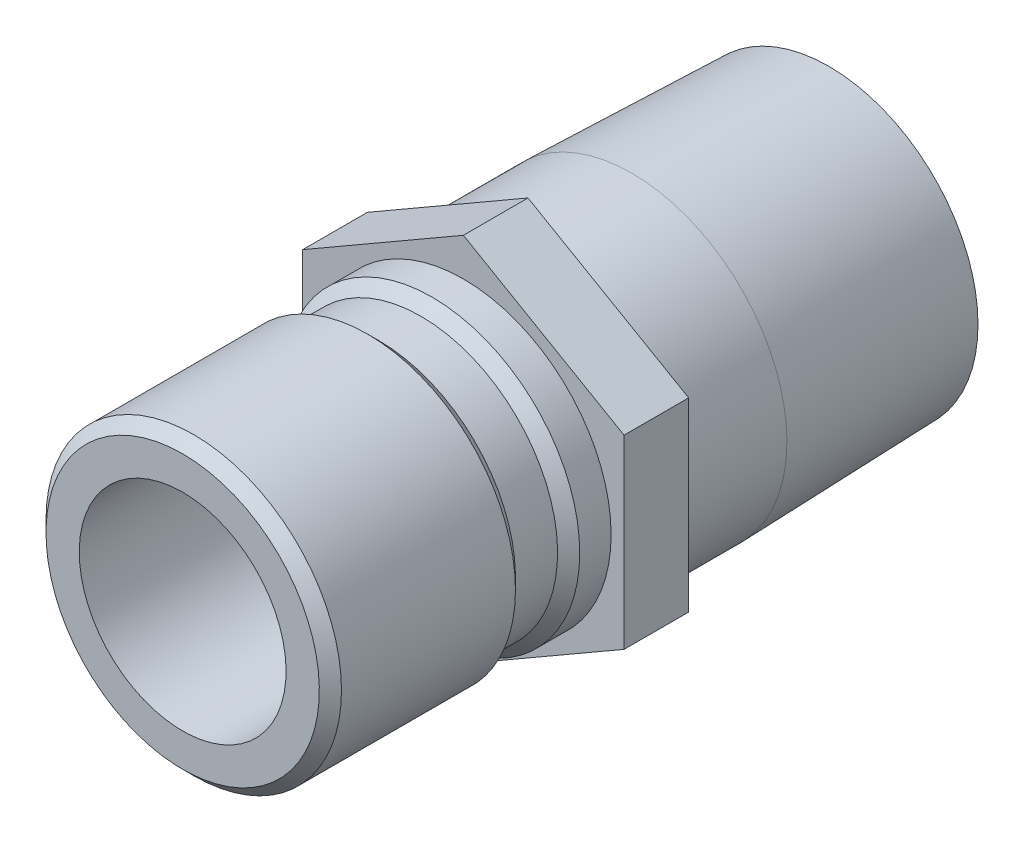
ISO-10303-21;
HEADER;
FILE_DESCRIPTION(('STEP AP214'),'2;1');
FILE_NAME('part.step','',(''),(''),'','','');
FILE_SCHEMA(('AUTOMOTIVE_DESIGN { 1 0 10303 214 1 1 1 1 }'));
ENDSEC;
DATA;
#1=APPLICATION_CONTEXT('core data for automotive mechanical design processes');
#2=APPLICATION_PROTOCOL_DEFINITION('international standard','automotive_design',2000,#1);
#3=PRODUCT_CONTEXT('',#1,'mechanical');
#4=PRODUCT('Part','Part','',(#3));
#5=PRODUCT_RELATED_PRODUCT_CATEGORY('part','',(#4));
#6=PRODUCT_DEFINITION_FORMATION('','',#4);
#7=PRODUCT_DEFINITION_CONTEXT('part definition',#1,'design');
#8=PRODUCT_DEFINITION('design','',#6,#7);
#9=PRODUCT_DEFINITION_SHAPE('','',#8);
#10=(LENGTH_UNIT() NAMED_UNIT(*) SI_UNIT(.MILLI.,.METRE.));
#11=(NAMED_UNIT(*) PLANE_ANGLE_UNIT() SI_UNIT($,.RADIAN.));
#12=(NAMED_UNIT(*) SI_UNIT($,.STERADIAN.) SOLID_ANGLE_UNIT());
#13=UNCERTAINTY_MEASURE_WITH_UNIT(LENGTH_MEASURE(1.E-05),#10,'distance_accuracy_value','');
#14=(GEOMETRIC_REPRESENTATION_CONTEXT(3) GLOBAL_UNCERTAINTY_ASSIGNED_CONTEXT((#13)) GLOBAL_UNIT_ASSIGNED_CONTEXT((#10,
#11,#12)) REPRESENTATION_CONTEXT('',''));
#15=CARTESIAN_POINT('',(0.,0.,0.));
#16=DIRECTION('',(0.,0.,1.));
#17=DIRECTION('',(1.,0.,0.));
#18=AXIS2_PLACEMENT_3D('',#15,#16,#17);
#19=CARTESIAN_POINT('',(0.,0.,0.));
#20=DIRECTION('',(0.,0.,-1.));
#21=DIRECTION('',(0.,1.,0.));
#22=AXIS2_PLACEMENT_3D('',#19,#20,#21);
#23=CYLINDRICAL_SURFACE('',#22,10.668);
#24=CARTESIAN_POINT('',(0.,0.,-11.5824));
#25=DIRECTION('',(0.,0.,-1.));
#26=DIRECTION('',(0.,1.,0.));
#27=AXIS2_PLACEMENT_3D('',#24,#25,#26);
#28=CIRCLE('',#27,10.668);
#29=CARTESIAN_POINT('',(0.,10.668,-11.5824));
#30=VERTEX_POINT('',#29);
#31=EDGE_CURVE('E42',#30,#30,#28,.T.);
#32=ORIENTED_EDGE('',*,*,#31,.F.);
#33=EDGE_LOOP('',(#32));
#34=FACE_BOUND('',#33,.T.);
#35=CARTESIAN_POINT('',(0.,0.,-4.445));
#36=DIRECTION('',(0.,0.,1.));
#37=DIRECTION('',(1.,0.,0.));
#38=AXIS2_PLACEMENT_3D('',#35,#36,#37);
#39=CIRCLE('',#38,10.668);
#40=CARTESIAN_POINT('',(10.668,0.,-4.445));
#41=VERTEX_POINT('',#40);
#42=EDGE_CURVE('E138',#41,#41,#39,.F.);
#43=ORIENTED_EDGE('',*,*,#42,.T.);
#44=EDGE_LOOP('',(#43));
#45=FACE_BOUND('',#44,.T.);
#46=ADVANCED_FACE('F33',(#34,#45),#23,.T.);
#47=CARTESIAN_POINT('',(0.,10.244140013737,-25.146));
#48=DIRECTION('',(0.,0.,-1.));
#49=DIRECTION('',(0.,1.,0.));
#50=AXIS2_PLACEMENT_3D('',#47,#48,#49);
#51=PLANE('',#50);
#52=CARTESIAN_POINT('',(0.,0.,-25.146));
#53=DIRECTION('',(0.,0.,-1.));
#54=DIRECTION('',(0.,1.,0.));
#55=AXIS2_PLACEMENT_3D('',#52,#53,#54);
#56=CIRCLE('',#55,10.244140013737);
#57=CARTESIAN_POINT('',(0.,10.244140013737,-25.146));
#58=VERTEX_POINT('',#57);
#59=EDGE_CURVE('E12',#58,#58,#56,.T.);
#60=ORIENTED_EDGE('',*,*,#59,.T.);
#61=EDGE_LOOP('',(#60));
#62=FACE_BOUND('',#61,.T.);
#63=CARTESIAN_POINT('',(0.,0.,-25.146));
#64=DIRECTION('',(0.,0.,-1.));
#65=DIRECTION('',(0.,1.,0.));
#66=AXIS2_PLACEMENT_3D('',#63,#64,#65);
#67=CIRCLE('',#66,7.8994);
#68=CARTESIAN_POINT('',(0.,7.8994,-25.146));
#69=VERTEX_POINT('',#68);
#70=EDGE_CURVE('E146',#69,#69,#67,.T.);
#71=ORIENTED_EDGE('',*,*,#70,.F.);
#72=EDGE_LOOP('',(#71));
#73=FACE_BOUND('',#72,.T.);
#74=ADVANCED_FACE('F35',(#62,#73),#51,.T.);
#75=CARTESIAN_POINT('',(0.,0.,-25.146));
#76=DIRECTION('',(0.,0.,1.));
#77=DIRECTION('',(0.,-1.,0.));
#78=AXIS2_PLACEMENT_3D('',#75,#76,#77);
#79=CONICAL_SURFACE('',#78,10.244140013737,0.0312396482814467);
#80=ORIENTED_EDGE('',*,*,#31,.T.);
#81=EDGE_LOOP('',(#80));
#82=FACE_BOUND('',#81,.T.);
#83=ORIENTED_EDGE('',*,*,#59,.F.);
#84=EDGE_LOOP('',(#83));
#85=FACE_BOUND('',#84,.T.);
#86=ADVANCED_FACE('F181',(#82,#85),#79,.T.);
#87=CARTESIAN_POINT('',(0.,10.16,0.));
#88=DIRECTION('',(0.,0.,1.));
#89=DIRECTION('',(0.,-1.,0.));
#90=AXIS2_PLACEMENT_3D('',#87,#88,#89);
#91=PLANE('',#90);
#92=CARTESIAN_POINT('',(0.,0.,0.));
#93=DIRECTION('',(0.,0.,-1.));
#94=DIRECTION('',(0.,1.,0.));
#95=AXIS2_PLACEMENT_3D('',#92,#93,#94);
#96=CIRCLE('',#95,10.16);
#97=CARTESIAN_POINT('',(0.,10.16,0.));
#98=VERTEX_POINT('',#97);
#99=EDGE_CURVE('E176',#98,#98,#96,.T.);
#100=ORIENTED_EDGE('',*,*,#99,.T.);
#101=EDGE_LOOP('',(#100));
#102=FACE_BOUND('',#101,.T.);
#103=DIRECTION('',(-0.866025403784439,-0.5,0.));
#104=VECTOR('',#103,1.);
#105=CARTESIAN_POINT('',(0.,12.7582862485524,0.));
#106=LINE('',#105,#104);
#107=CARTESIAN_POINT('',(0.,12.7582862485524,0.));
#108=VERTEX_POINT('',#107);
#109=CARTESIAN_POINT('',(-11.049,6.37914312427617,0.));
#110=VERTEX_POINT('',#109);
#111=EDGE_CURVE('E121',#108,#110,#106,.T.);
#112=ORIENTED_EDGE('',*,*,#111,.T.);
#113=DIRECTION('',(0.,-1.,0.));
#114=VECTOR('',#113,1.);
#115=CARTESIAN_POINT('',(-11.049,6.37914312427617,0.));
#116=LINE('',#115,#114);
#117=CARTESIAN_POINT('',(-11.049,-6.37914312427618,0.));
#118=VERTEX_POINT('',#117);
#119=EDGE_CURVE('E124',#110,#118,#116,.T.);
#120=ORIENTED_EDGE('',*,*,#119,.T.);
#121=DIRECTION('',(0.866025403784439,-0.5,0.));
#122=VECTOR('',#121,1.);
#123=CARTESIAN_POINT('',(-11.049,-6.37914312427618,0.));
#124=LINE('',#123,#122);
#125=CARTESIAN_POINT('',(0.,-12.7582862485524,0.));
#126=VERTEX_POINT('',#125);
#127=EDGE_CURVE('E127',#118,#126,#124,.T.);
#128=ORIENTED_EDGE('',*,*,#127,.T.);
#129=DIRECTION('',(0.866025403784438,0.5,0.));
#130=VECTOR('',#129,1.);
#131=CARTESIAN_POINT('',(0.,-12.7582862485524,0.));
#132=LINE('',#131,#130);
#133=CARTESIAN_POINT('',(11.049,-6.37914312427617,0.));
#134=VERTEX_POINT('',#133);
#135=EDGE_CURVE('E130',#126,#134,#132,.T.);
#136=ORIENTED_EDGE('',*,*,#135,.T.);
#137=DIRECTION('',(0.,1.,0.));
#138=VECTOR('',#137,1.);
#139=CARTESIAN_POINT('',(11.049,-6.37914312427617,0.));
#140=LINE('',#139,#138);
#141=CARTESIAN_POINT('',(11.049,6.37914312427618,0.));
#142=VERTEX_POINT('',#141);
#143=EDGE_CURVE('E98',#134,#142,#140,.T.);
#144=ORIENTED_EDGE('',*,*,#143,.T.);
#145=DIRECTION('',(-0.866025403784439,0.5,0.));
#146=VECTOR('',#145,1.);
#147=CARTESIAN_POINT('',(11.049,6.37914312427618,0.));
#148=LINE('',#147,#146);
#149=EDGE_CURVE('E133',#142,#108,#148,.T.);
#150=ORIENTED_EDGE('',*,*,#149,.T.);
#151=EDGE_LOOP('',(#112,#120,#128,#136,#144,#150));
#152=FACE_BOUND('',#151,.T.);
#153=ADVANCED_FACE('F250',(#102,#152),#91,.T.);
#154=CARTESIAN_POINT('',(0.,0.,0.));
#155=DIRECTION('',(0.,0.,-1.));
#156=DIRECTION('',(0.,1.,0.));
#157=AXIS2_PLACEMENT_3D('',#154,#155,#156);
#158=CYLINDRICAL_SURFACE('',#157,10.16);
#159=CARTESIAN_POINT('',(0.,0.,2.159));
#160=DIRECTION('',(0.,0.,-1.));
#161=DIRECTION('',(0.,1.,0.));
#162=AXIS2_PLACEMENT_3D('',#159,#160,#161);
#163=CIRCLE('',#162,10.16);
#164=CARTESIAN_POINT('',(0.,10.16,2.159));
#165=VERTEX_POINT('',#164);
#166=EDGE_CURVE('E173',#165,#165,#163,.T.);
#167=ORIENTED_EDGE('',*,*,#166,.T.);
#168=EDGE_LOOP('',(#167));
#169=FACE_BOUND('',#168,.T.);
#170=ORIENTED_EDGE('',*,*,#99,.F.);
#171=EDGE_LOOP('',(#170));
#172=FACE_BOUND('',#171,.T.);
#173=ADVANCED_FACE('F246',(#169,#172),#158,.T.);
#174=CARTESIAN_POINT('',(0.,0.,2.159));
#175=DIRECTION('',(0.,0.,-1.));
#176=DIRECTION('',(0.,1.,0.));
#177=AXIS2_PLACEMENT_3D('',#174,#175,#176);
#178=CONICAL_SURFACE('',#177,10.16,0.785398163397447);
#179=CARTESIAN_POINT('',(0.,0.,2.921));
#180=DIRECTION('',(0.,0.,-1.));
#181=DIRECTION('',(0.,1.,0.));
#182=AXIS2_PLACEMENT_3D('',#179,#180,#181);
#183=CIRCLE('',#182,9.398);
#184=CARTESIAN_POINT('',(0.,9.398,2.921));
#185=VERTEX_POINT('',#184);
#186=EDGE_CURVE('E170',#185,#185,#183,.T.);
#187=ORIENTED_EDGE('',*,*,#186,.T.);
#188=EDGE_LOOP('',(#187));
#189=FACE_BOUND('',#188,.T.);
#190=ORIENTED_EDGE('',*,*,#166,.F.);
#191=EDGE_LOOP('',(#190));
#192=FACE_BOUND('',#191,.T.);
#193=ADVANCED_FACE('F242',(#189,#192),#178,.T.);
#194=CARTESIAN_POINT('',(0.,0.,0.));
#195=DIRECTION('',(0.,0.,-1.));
#196=DIRECTION('',(0.,1.,0.));
#197=AXIS2_PLACEMENT_3D('',#194,#195,#196);
#198=CYLINDRICAL_SURFACE('',#197,9.398);
#199=CARTESIAN_POINT('',(0.,0.,5.8166));
#200=DIRECTION('',(0.,0.,-1.));
#201=DIRECTION('',(0.,1.,0.));
#202=AXIS2_PLACEMENT_3D('',#199,#200,#201);
#203=CIRCLE('',#202,9.398);
#204=CARTESIAN_POINT('',(0.,9.398,5.8166));
#205=VERTEX_POINT('',#204);
#206=EDGE_CURVE('E167',#205,#205,#203,.T.);
#207=ORIENTED_EDGE('',*,*,#206,.T.);
#208=EDGE_LOOP('',(#207));
#209=FACE_BOUND('',#208,.T.);
#210=ORIENTED_EDGE('',*,*,#186,.F.);
#211=EDGE_LOOP('',(#210));
#212=FACE_BOUND('',#211,.T.);
#213=ADVANCED_FACE('F238',(#209,#212),#198,.T.);
#214=CARTESIAN_POINT('',(0.,0.,5.8166));
#215=DIRECTION('',(0.,0.,1.));
#216=DIRECTION('',(0.,-1.,0.));
#217=AXIS2_PLACEMENT_3D('',#214,#215,#216);
#218=CONICAL_SURFACE('',#217,9.398,0.785398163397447);
#219=CARTESIAN_POINT('',(0.,0.,6.5786));
#220=DIRECTION('',(0.,0.,-1.));
#221=DIRECTION('',(0.,1.,0.));
#222=AXIS2_PLACEMENT_3D('',#219,#220,#221);
#223=CIRCLE('',#222,10.16);
#224=CARTESIAN_POINT('',(0.,10.16,6.5786));
#225=VERTEX_POINT('',#224);
#226=EDGE_CURVE('E164',#225,#225,#223,.T.);
#227=ORIENTED_EDGE('',*,*,#226,.T.);
#228=EDGE_LOOP('',(#227));
#229=FACE_BOUND('',#228,.T.);
#230=ORIENTED_EDGE('',*,*,#206,.F.);
#231=EDGE_LOOP('',(#230));
#232=FACE_BOUND('',#231,.T.);
#233=ADVANCED_FACE('F234',(#229,#232),#218,.T.);
#234=CARTESIAN_POINT('',(0.,0.,0.));
#235=DIRECTION('',(0.,0.,-1.));
#236=DIRECTION('',(0.,1.,0.));
#237=AXIS2_PLACEMENT_3D('',#234,#235,#236);
#238=CYLINDRICAL_SURFACE('',#237,10.16);
#239=CARTESIAN_POINT('',(0.,0.,18.542));
#240=DIRECTION('',(0.,0.,-1.));
#241=DIRECTION('',(0.,1.,0.));
#242=AXIS2_PLACEMENT_3D('',#239,#240,#241);
#243=CIRCLE('',#242,10.16);
#244=CARTESIAN_POINT('',(0.,10.16,18.542));
#245=VERTEX_POINT('',#244);
#246=EDGE_CURVE('E161',#245,#245,#243,.T.);
#247=ORIENTED_EDGE('',*,*,#246,.T.);
#248=EDGE_LOOP('',(#247));
#249=FACE_BOUND('',#248,.T.);
#250=ORIENTED_EDGE('',*,*,#226,.F.);
#251=EDGE_LOOP('',(#250));
#252=FACE_BOUND('',#251,.T.);
#253=ADVANCED_FACE('F230',(#249,#252),#238,.T.);
#254=CARTESIAN_POINT('',(0.,0.,18.542));
#255=DIRECTION('',(0.,0.,-1.));
#256=DIRECTION('',(0.,1.,0.));
#257=AXIS2_PLACEMENT_3D('',#254,#255,#256);
#258=CONICAL_SURFACE('',#257,10.16,0.785398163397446);
#259=CARTESIAN_POINT('',(0.,0.,19.304));
#260=DIRECTION('',(0.,0.,-1.));
#261=DIRECTION('',(0.,1.,0.));
#262=AXIS2_PLACEMENT_3D('',#259,#260,#261);
#263=CIRCLE('',#262,9.398);
#264=CARTESIAN_POINT('',(0.,9.398,19.304));
#265=VERTEX_POINT('',#264);
#266=EDGE_CURVE('E158',#265,#265,#263,.T.);
#267=ORIENTED_EDGE('',*,*,#266,.T.);
#268=EDGE_LOOP('',(#267));
#269=FACE_BOUND('',#268,.T.);
#270=ORIENTED_EDGE('',*,*,#246,.F.);
#271=EDGE_LOOP('',(#270));
#272=FACE_BOUND('',#271,.T.);
#273=ADVANCED_FACE('F226',(#269,#272),#258,.T.);
#274=CARTESIAN_POINT('',(0.,7.112,19.304));
#275=DIRECTION('',(0.,0.,1.));
#276=DIRECTION('',(0.,-1.,0.));
#277=AXIS2_PLACEMENT_3D('',#274,#275,#276);
#278=PLANE('',#277);
#279=CARTESIAN_POINT('',(0.,0.,19.304));
#280=DIRECTION('',(0.,0.,-1.));
#281=DIRECTION('',(0.,1.,0.));
#282=AXIS2_PLACEMENT_3D('',#279,#280,#281);
#283=CIRCLE('',#282,7.112);
#284=CARTESIAN_POINT('',(0.,7.112,19.304));
#285=VERTEX_POINT('',#284);
#286=EDGE_CURVE('E155',#285,#285,#283,.T.);
#287=ORIENTED_EDGE('',*,*,#286,.T.);
#288=EDGE_LOOP('',(#287));
#289=FACE_BOUND('',#288,.T.);
#290=ORIENTED_EDGE('',*,*,#266,.F.);
#291=EDGE_LOOP('',(#290));
#292=FACE_BOUND('',#291,.T.);
#293=ADVANCED_FACE('F222',(#289,#292),#278,.T.);
#294=CARTESIAN_POINT('',(0.,0.,0.));
#295=DIRECTION('',(0.,0.,-1.));
#296=DIRECTION('',(0.,1.,0.));
#297=AXIS2_PLACEMENT_3D('',#294,#295,#296);
#298=CYLINDRICAL_SURFACE('',#297,7.112);
#299=CARTESIAN_POINT('',(0.,0.,1.524));
#300=DIRECTION('',(0.,0.,-1.));
#301=DIRECTION('',(0.,1.,0.));
#302=AXIS2_PLACEMENT_3D('',#299,#300,#301);
#303=CIRCLE('',#302,7.112);
#304=CARTESIAN_POINT('',(0.,7.112,1.524));
#305=VERTEX_POINT('',#304);
#306=EDGE_CURVE('E152',#305,#305,#303,.T.);
#307=ORIENTED_EDGE('',*,*,#306,.T.);
#308=EDGE_LOOP('',(#307));
#309=FACE_BOUND('',#308,.T.);
#310=ORIENTED_EDGE('',*,*,#286,.F.);
#311=EDGE_LOOP('',(#310));
#312=FACE_BOUND('',#311,.T.);
#313=ADVANCED_FACE('F218',(#309,#312),#298,.F.);
#314=CARTESIAN_POINT('',(0.,0.,1.524));
#315=DIRECTION('',(0.,0.,-1.));
#316=DIRECTION('',(0.,1.,0.));
#317=AXIS2_PLACEMENT_3D('',#314,#315,#316);
#318=CONICAL_SURFACE('',#317,7.112,1.08210413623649);
#319=CARTESIAN_POINT('',(0.,0.,1.10533199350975));
#320=DIRECTION('',(0.,0.,-1.));
#321=DIRECTION('',(0.,1.,0.));
#322=AXIS2_PLACEMENT_3D('',#319,#320,#321);
#323=CIRCLE('',#322,7.8994);
#324=CARTESIAN_POINT('',(0.,7.8994,1.10533199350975));
#325=VERTEX_POINT('',#324);
#326=EDGE_CURVE('E149',#325,#325,#323,.T.);
#327=ORIENTED_EDGE('',*,*,#326,.T.);
#328=EDGE_LOOP('',(#327));
#329=FACE_BOUND('',#328,.T.);
#330=ORIENTED_EDGE('',*,*,#306,.F.);
#331=EDGE_LOOP('',(#330));
#332=FACE_BOUND('',#331,.T.);
#333=ADVANCED_FACE('F214',(#329,#332),#318,.F.);
#334=CARTESIAN_POINT('',(0.,0.,0.));
#335=DIRECTION('',(0.,0.,-1.));
#336=DIRECTION('',(0.,1.,0.));
#337=AXIS2_PLACEMENT_3D('',#334,#335,#336);
#338=CYLINDRICAL_SURFACE('',#337,7.8994);
#339=ORIENTED_EDGE('',*,*,#326,.F.);
#340=EDGE_LOOP('',(#339));
#341=FACE_BOUND('',#340,.T.);
#342=ORIENTED_EDGE('',*,*,#70,.T.);
#343=EDGE_LOOP('',(#342));
#344=FACE_BOUND('',#343,.T.);
#345=ADVANCED_FACE('F211',(#341,#344),#338,.F.);
#346=CARTESIAN_POINT('',(0.,12.7582862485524,-4.445));
#347=DIRECTION('',(-0.5,0.866025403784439,0.));
#348=DIRECTION('',(-0.866025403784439,-0.5,0.));
#349=AXIS2_PLACEMENT_3D('',#346,#347,#348);
#350=PLANE('',#349);
#351=ORIENTED_EDGE('',*,*,#111,.F.);
#352=DIRECTION('',(0.,0.,1.));
#353=VECTOR('',#352,1.);
#354=CARTESIAN_POINT('',(0.,12.7582862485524,-4.445));
#355=LINE('',#354,#353);
#356=CARTESIAN_POINT('',(0.,12.7582862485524,-4.445));
#357=VERTEX_POINT('',#356);
#358=EDGE_CURVE('E50',#357,#108,#355,.T.);
#359=ORIENTED_EDGE('',*,*,#358,.F.);
#360=DIRECTION('',(-0.866025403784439,-0.5,0.));
#361=VECTOR('',#360,1.);
#362=CARTESIAN_POINT('',(0.,12.7582862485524,-4.445));
#363=LINE('',#362,#361);
#364=CARTESIAN_POINT('',(-11.049,6.37914312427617,-4.445));
#365=VERTEX_POINT('',#364);
#366=EDGE_CURVE('E136',#357,#365,#363,.T.);
#367=ORIENTED_EDGE('',*,*,#366,.T.);
#368=DIRECTION('',(0.,0.,1.));
#369=VECTOR('',#368,1.);
#370=CARTESIAN_POINT('',(-11.049,6.37914312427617,-4.445));
#371=LINE('',#370,#369);
#372=EDGE_CURVE('E85',#365,#110,#371,.T.);
#373=ORIENTED_EDGE('',*,*,#372,.T.);
#374=EDGE_LOOP('',(#351,#359,#367,#373));
#375=FACE_BOUND('',#374,.T.);
#376=ADVANCED_FACE('F201',(#375),#350,.T.);
#377=CARTESIAN_POINT('',(11.049,6.37914312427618,-4.445));
#378=DIRECTION('',(0.5,0.866025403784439,0.));
#379=DIRECTION('',(-0.866025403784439,0.5,0.));
#380=AXIS2_PLACEMENT_3D('',#377,#378,#379);
#381=PLANE('',#380);
#382=ORIENTED_EDGE('',*,*,#149,.F.);
#383=DIRECTION('',(0.,0.,1.));
#384=VECTOR('',#383,1.);
#385=CARTESIAN_POINT('',(11.049,6.37914312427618,-4.445));
#386=LINE('',#385,#384);
#387=CARTESIAN_POINT('',(11.049,6.37914312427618,-4.445));
#388=VERTEX_POINT('',#387);
#389=EDGE_CURVE('E73',#388,#142,#386,.T.);
#390=ORIENTED_EDGE('',*,*,#389,.F.);
#391=DIRECTION('',(-0.866025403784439,0.5,0.));
#392=VECTOR('',#391,1.);
#393=CARTESIAN_POINT('',(11.049,6.37914312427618,-4.445));
#394=LINE('',#393,#392);
#395=EDGE_CURVE('E111',#388,#357,#394,.T.);
#396=ORIENTED_EDGE('',*,*,#395,.T.);
#397=ORIENTED_EDGE('',*,*,#358,.T.);
#398=EDGE_LOOP('',(#382,#390,#396,#397));
#399=FACE_BOUND('',#398,.T.);
#400=ADVANCED_FACE('F198',(#399),#381,.T.);
#401=CARTESIAN_POINT('',(11.049,-6.37914312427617,-4.445));
#402=DIRECTION('',(1.,0.,0.));
#403=DIRECTION('',(0.,0.,-1.));
#404=AXIS2_PLACEMENT_3D('',#401,#402,#403);
#405=PLANE('',#404);
#406=ORIENTED_EDGE('',*,*,#143,.F.);
#407=DIRECTION('',(0.,0.,1.));
#408=VECTOR('',#407,1.);
#409=CARTESIAN_POINT('',(11.049,-6.37914312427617,-4.445));
#410=LINE('',#409,#408);
#411=CARTESIAN_POINT('',(11.049,-6.37914312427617,-4.445));
#412=VERTEX_POINT('',#411);
#413=EDGE_CURVE('E93',#412,#134,#410,.T.);
#414=ORIENTED_EDGE('',*,*,#413,.F.);
#415=DIRECTION('',(0.,1.,0.));
#416=VECTOR('',#415,1.);
#417=CARTESIAN_POINT('',(11.049,-6.37914312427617,-4.445));
#418=LINE('',#417,#416);
#419=EDGE_CURVE('E96',#412,#388,#418,.T.);
#420=ORIENTED_EDGE('',*,*,#419,.T.);
#421=ORIENTED_EDGE('',*,*,#389,.T.);
#422=EDGE_LOOP('',(#406,#414,#420,#421));
#423=FACE_BOUND('',#422,.T.);
#424=ADVANCED_FACE('F95',(#423),#405,.T.);
#425=CARTESIAN_POINT('',(0.,-12.7582862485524,-4.445));
#426=DIRECTION('',(0.5,-0.866025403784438,0.));
#427=DIRECTION('',(0.866025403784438,0.5,0.));
#428=AXIS2_PLACEMENT_3D('',#425,#426,#427);
#429=PLANE('',#428);
#430=ORIENTED_EDGE('',*,*,#135,.F.);
#431=DIRECTION('',(0.,0.,1.));
#432=VECTOR('',#431,1.);
#433=CARTESIAN_POINT('',(0.,-12.7582862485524,-4.445));
#434=LINE('',#433,#432);
#435=CARTESIAN_POINT('',(0.,-12.7582862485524,-4.445));
#436=VERTEX_POINT('',#435);
#437=EDGE_CURVE('E103',#436,#126,#434,.T.);
#438=ORIENTED_EDGE('',*,*,#437,.F.);
#439=DIRECTION('',(0.866025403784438,0.5,0.));
#440=VECTOR('',#439,1.);
#441=CARTESIAN_POINT('',(0.,-12.7582862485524,-4.445));
#442=LINE('',#441,#440);
#443=EDGE_CURVE('E109',#436,#412,#442,.T.);
#444=ORIENTED_EDGE('',*,*,#443,.T.);
#445=ORIENTED_EDGE('',*,*,#413,.T.);
#446=EDGE_LOOP('',(#430,#438,#444,#445));
#447=FACE_BOUND('',#446,.T.);
#448=ADVANCED_FACE('F113',(#447),#429,.T.);
#449=CARTESIAN_POINT('',(-11.049,-6.37914312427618,-4.445));
#450=DIRECTION('',(-0.5,-0.866025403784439,0.));
#451=DIRECTION('',(0.866025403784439,-0.5,0.));
#452=AXIS2_PLACEMENT_3D('',#449,#450,#451);
#453=PLANE('',#452);
#454=ORIENTED_EDGE('',*,*,#127,.F.);
#455=DIRECTION('',(0.,0.,1.));
#456=VECTOR('',#455,1.);
#457=CARTESIAN_POINT('',(-11.049,-6.37914312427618,-4.445));
#458=LINE('',#457,#456);
#459=CARTESIAN_POINT('',(-11.049,-6.37914312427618,-4.445));
#460=VERTEX_POINT('',#459);
#461=EDGE_CURVE('E141',#460,#118,#458,.T.);
#462=ORIENTED_EDGE('',*,*,#461,.F.);
#463=DIRECTION('',(0.866025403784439,-0.5,0.));
#464=VECTOR('',#463,1.);
#465=CARTESIAN_POINT('',(-11.049,-6.37914312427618,-4.445));
#466=LINE('',#465,#464);
#467=EDGE_CURVE('E114',#460,#436,#466,.T.);
#468=ORIENTED_EDGE('',*,*,#467,.T.);
#469=ORIENTED_EDGE('',*,*,#437,.T.);
#470=EDGE_LOOP('',(#454,#462,#468,#469));
#471=FACE_BOUND('',#470,.T.);
#472=ADVANCED_FACE('F195',(#471),#453,.T.);
#473=CARTESIAN_POINT('',(-11.049,6.37914312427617,-4.445));
#474=DIRECTION('',(-1.,0.,0.));
#475=DIRECTION('',(0.,0.,1.));
#476=AXIS2_PLACEMENT_3D('',#473,#474,#475);
#477=PLANE('',#476);
#478=ORIENTED_EDGE('',*,*,#119,.F.);
#479=ORIENTED_EDGE('',*,*,#372,.F.);
#480=DIRECTION('',(0.,-1.,0.));
#481=VECTOR('',#480,1.);
#482=CARTESIAN_POINT('',(-11.049,6.37914312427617,-4.445));
#483=LINE('',#482,#481);
#484=EDGE_CURVE('E116',#365,#460,#483,.T.);
#485=ORIENTED_EDGE('',*,*,#484,.T.);
#486=ORIENTED_EDGE('',*,*,#461,.T.);
#487=EDGE_LOOP('',(#478,#479,#485,#486));
#488=FACE_BOUND('',#487,.T.);
#489=ADVANCED_FACE('F190',(#488),#477,.T.);
#490=CARTESIAN_POINT('',(-11.049,6.37914312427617,-4.445));
#491=DIRECTION('',(0.,0.,1.));
#492=DIRECTION('',(1.,0.,0.));
#493=AXIS2_PLACEMENT_3D('',#490,#491,#492);
#494=PLANE('',#493);
#495=ORIENTED_EDGE('',*,*,#42,.F.);
#496=EDGE_LOOP('',(#495));
#497=FACE_BOUND('',#496,.T.);
#498=ORIENTED_EDGE('',*,*,#366,.F.);
#499=ORIENTED_EDGE('',*,*,#395,.F.);
#500=ORIENTED_EDGE('',*,*,#419,.F.);
#501=ORIENTED_EDGE('',*,*,#443,.F.);
#502=ORIENTED_EDGE('',*,*,#467,.F.);
#503=ORIENTED_EDGE('',*,*,#484,.F.);
#504=EDGE_LOOP('',(#498,#499,#500,#501,#502,#503));
#505=FACE_BOUND('',#504,.T.);
#506=ADVANCED_FACE('F107',(#497,#505),#494,.F.);
#507=CLOSED_SHELL('',(#46,#74,#86,#153,#173,#193,#213,#233,#253,#273,#293,#313,#333,#345,#376,
#400,#424,#448,#472,#489,#506));
#508=MANIFOLD_SOLID_BREP('B2',#507);
#509=ADVANCED_BREP_SHAPE_REPRESENTATION('',(#18,#508),#14);
#510=SHAPE_DEFINITION_REPRESENTATION(#9,#509);
ENDSEC;
END-ISO-10303-21;
